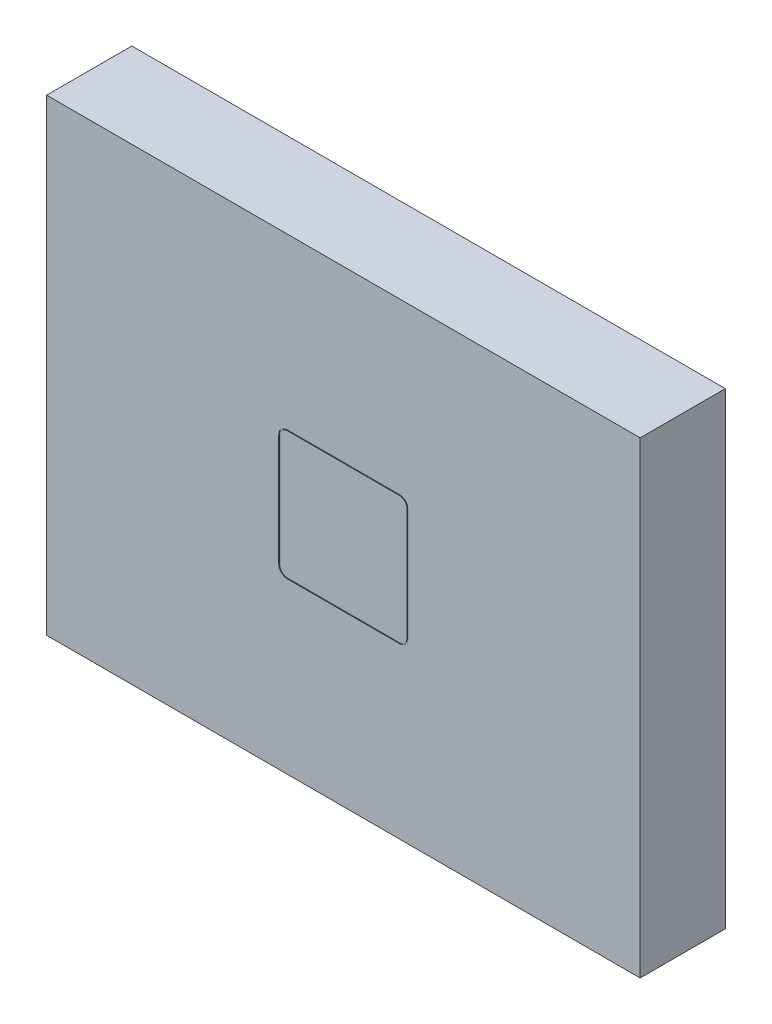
ISO-10303-21;
HEADER;
FILE_DESCRIPTION(('STEP AP214'),'2;1');
FILE_NAME('part.step','',(''),(''),'','','');
FILE_SCHEMA(('AUTOMOTIVE_DESIGN { 1 0 10303 214 1 1 1 1 }'));
ENDSEC;
DATA;
#1=APPLICATION_CONTEXT('core data for automotive mechanical design processes');
#2=APPLICATION_PROTOCOL_DEFINITION('international standard','automotive_design',2000,#1);
#3=PRODUCT_CONTEXT('',#1,'mechanical');
#4=PRODUCT('Part','Part','',(#3));
#5=PRODUCT_RELATED_PRODUCT_CATEGORY('part','',(#4));
#6=PRODUCT_DEFINITION_FORMATION('','',#4);
#7=PRODUCT_DEFINITION_CONTEXT('part definition',#1,'design');
#8=PRODUCT_DEFINITION('design','',#6,#7);
#9=PRODUCT_DEFINITION_SHAPE('','',#8);
#10=(LENGTH_UNIT() NAMED_UNIT(*) SI_UNIT(.MILLI.,.METRE.));
#11=(NAMED_UNIT(*) PLANE_ANGLE_UNIT() SI_UNIT($,.RADIAN.));
#12=(NAMED_UNIT(*) SI_UNIT($,.STERADIAN.) SOLID_ANGLE_UNIT());
#13=UNCERTAINTY_MEASURE_WITH_UNIT(LENGTH_MEASURE(1.E-05),#10,'distance_accuracy_value','');
#14=(GEOMETRIC_REPRESENTATION_CONTEXT(3) GLOBAL_UNCERTAINTY_ASSIGNED_CONTEXT((#13)) GLOBAL_UNIT_ASSIGNED_CONTEXT((#10,
#11,#12)) REPRESENTATION_CONTEXT('',''));
#15=CARTESIAN_POINT('',(0.,0.,0.));
#16=DIRECTION('',(0.,0.,1.));
#17=DIRECTION('',(1.,0.,0.));
#18=AXIS2_PLACEMENT_3D('',#15,#16,#17);
#19=CARTESIAN_POINT('',(-42500.,33500.,12195.2));
#20=DIRECTION('',(0.,-1.,0.));
#21=DIRECTION('',(1.,0.,0.));
#22=AXIS2_PLACEMENT_3D('',#19,#20,#21);
#23=PLANE('',#22);
#24=DIRECTION('',(-1.,0.,0.));
#25=VECTOR('',#24,1.);
#26=CARTESIAN_POINT('',(-42500.,33500.,0.));
#27=LINE('',#26,#25);
#28=CARTESIAN_POINT('',(42500.,33500.,0.));
#29=VERTEX_POINT('',#28);
#30=CARTESIAN_POINT('',(-42500.,33500.,0.));
#31=VERTEX_POINT('',#30);
#32=EDGE_CURVE('E350',#29,#31,#27,.T.);
#33=ORIENTED_EDGE('',*,*,#32,.T.);
#34=DIRECTION('',(0.,0.,-1.));
#35=VECTOR('',#34,1.);
#36=CARTESIAN_POINT('',(-42500.,33500.,12195.2));
#37=LINE('',#36,#35);
#38=CARTESIAN_POINT('',(-42500.,33500.,12195.2));
#39=VERTEX_POINT('',#38);
#40=EDGE_CURVE('E11',#39,#31,#37,.T.);
#41=ORIENTED_EDGE('',*,*,#40,.F.);
#42=DIRECTION('',(-1.,0.,0.));
#43=VECTOR('',#42,1.);
#44=CARTESIAN_POINT('',(-42500.,33500.,12195.2));
#45=LINE('',#44,#43);
#46=CARTESIAN_POINT('',(42500.,33500.,12195.2));
#47=VERTEX_POINT('',#46);
#48=EDGE_CURVE('E366',#47,#39,#45,.T.);
#49=ORIENTED_EDGE('',*,*,#48,.F.);
#50=DIRECTION('',(0.,0.,-1.));
#51=VECTOR('',#50,1.);
#52=CARTESIAN_POINT('',(42500.,33500.,12195.2));
#53=LINE('',#52,#51);
#54=EDGE_CURVE('E385',#47,#29,#53,.T.);
#55=ORIENTED_EDGE('',*,*,#54,.T.);
#56=EDGE_LOOP('',(#33,#41,#49,#55));
#57=FACE_BOUND('',#56,.T.);
#58=ADVANCED_FACE('F46',(#57),#23,.F.);
#59=CARTESIAN_POINT('',(-42500.,-33500.,12195.2));
#60=DIRECTION('',(1.,0.,0.));
#61=DIRECTION('',(0.,0.,-1.));
#62=AXIS2_PLACEMENT_3D('',#59,#60,#61);
#63=PLANE('',#62);
#64=DIRECTION('',(0.,-1.,0.));
#65=VECTOR('',#64,1.);
#66=CARTESIAN_POINT('',(-42500.,-33500.,0.));
#67=LINE('',#66,#65);
#68=CARTESIAN_POINT('',(-42500.,-33500.,0.));
#69=VERTEX_POINT('',#68);
#70=EDGE_CURVE('E387',#31,#69,#67,.T.);
#71=ORIENTED_EDGE('',*,*,#70,.T.);
#72=DIRECTION('',(0.,0.,-1.));
#73=VECTOR('',#72,1.);
#74=CARTESIAN_POINT('',(-42500.,-33500.,12195.2));
#75=LINE('',#74,#73);
#76=CARTESIAN_POINT('',(-42500.,-33500.,12195.2));
#77=VERTEX_POINT('',#76);
#78=EDGE_CURVE('E53',#77,#69,#75,.T.);
#79=ORIENTED_EDGE('',*,*,#78,.F.);
#80=DIRECTION('',(0.,-1.,0.));
#81=VECTOR('',#80,1.);
#82=CARTESIAN_POINT('',(-42500.,-33500.,12195.2));
#83=LINE('',#82,#81);
#84=EDGE_CURVE('E375',#39,#77,#83,.T.);
#85=ORIENTED_EDGE('',*,*,#84,.F.);
#86=ORIENTED_EDGE('',*,*,#40,.T.);
#87=EDGE_LOOP('',(#71,#79,#85,#86));
#88=FACE_BOUND('',#87,.T.);
#89=ADVANCED_FACE('F425',(#88),#63,.F.);
#90=CARTESIAN_POINT('',(-42500.,-33500.,12195.2));
#91=DIRECTION('',(0.,1.,0.));
#92=DIRECTION('',(0.,0.,1.));
#93=AXIS2_PLACEMENT_3D('',#90,#91,#92);
#94=PLANE('',#93);
#95=DIRECTION('',(1.,0.,0.));
#96=VECTOR('',#95,1.);
#97=CARTESIAN_POINT('',(-42500.,-33500.,0.));
#98=LINE('',#97,#96);
#99=CARTESIAN_POINT('',(42500.,-33500.,0.));
#100=VERTEX_POINT('',#99);
#101=EDGE_CURVE('E386',#69,#100,#98,.T.);
#102=ORIENTED_EDGE('',*,*,#101,.T.);
#103=DIRECTION('',(0.,0.,-1.));
#104=VECTOR('',#103,1.);
#105=CARTESIAN_POINT('',(42500.,-33500.,12195.2));
#106=LINE('',#105,#104);
#107=CARTESIAN_POINT('',(42500.,-33500.,12195.2));
#108=VERTEX_POINT('',#107);
#109=EDGE_CURVE('E397',#108,#100,#106,.T.);
#110=ORIENTED_EDGE('',*,*,#109,.F.);
#111=DIRECTION('',(1.,0.,0.));
#112=VECTOR('',#111,1.);
#113=CARTESIAN_POINT('',(-42500.,-33500.,12195.2));
#114=LINE('',#113,#112);
#115=EDGE_CURVE('E376',#77,#108,#114,.T.);
#116=ORIENTED_EDGE('',*,*,#115,.F.);
#117=ORIENTED_EDGE('',*,*,#78,.T.);
#118=EDGE_LOOP('',(#102,#110,#116,#117));
#119=FACE_BOUND('',#118,.T.);
#120=ADVANCED_FACE('F407',(#119),#94,.F.);
#121=CARTESIAN_POINT('',(42500.,-33500.,12195.2));
#122=DIRECTION('',(-1.,0.,0.));
#123=DIRECTION('',(0.,0.,1.));
#124=AXIS2_PLACEMENT_3D('',#121,#122,#123);
#125=PLANE('',#124);
#126=DIRECTION('',(0.,1.,0.));
#127=VECTOR('',#126,1.);
#128=CARTESIAN_POINT('',(42500.,-33500.,0.));
#129=LINE('',#128,#127);
#130=EDGE_CURVE('E373',#100,#29,#129,.T.);
#131=ORIENTED_EDGE('',*,*,#130,.T.);
#132=ORIENTED_EDGE('',*,*,#54,.F.);
#133=DIRECTION('',(0.,1.,0.));
#134=VECTOR('',#133,1.);
#135=CARTESIAN_POINT('',(42500.,-33500.,12195.2));
#136=LINE('',#135,#134);
#137=EDGE_CURVE('E377',#108,#47,#136,.T.);
#138=ORIENTED_EDGE('',*,*,#137,.F.);
#139=ORIENTED_EDGE('',*,*,#109,.T.);
#140=EDGE_LOOP('',(#131,#132,#138,#139));
#141=FACE_BOUND('',#140,.T.);
#142=ADVANCED_FACE('F415',(#141),#125,.F.);
#143=CARTESIAN_POINT('',(0.,0.,12195.2));
#144=DIRECTION('',(0.,0.,1.));
#145=DIRECTION('',(1.,0.,0.));
#146=AXIS2_PLACEMENT_3D('',#143,#144,#145);
#147=PLANE('',#146);
#148=CARTESIAN_POINT('',(-8000.72,8000.72,12195.2));
#149=DIRECTION('',(0.,0.,1.));
#150=DIRECTION('',(1.,0.,0.));
#151=AXIS2_PLACEMENT_3D('',#148,#149,#150);
#152=CIRCLE('',#151,1263.17);
#153=CARTESIAN_POINT('',(-8000.72,9263.89,12195.2));
#154=VERTEX_POINT('',#153);
#155=CARTESIAN_POINT('',(-9263.89,8000.72,12195.2));
#156=VERTEX_POINT('',#155);
#157=EDGE_CURVE('E62',#154,#156,#152,.T.);
#158=ORIENTED_EDGE('',*,*,#157,.F.);
#159=DIRECTION('',(-1.,0.,0.));
#160=VECTOR('',#159,1.);
#161=CARTESIAN_POINT('',(8000.71999999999,9263.89,12195.2));
#162=LINE('',#161,#160);
#163=CARTESIAN_POINT('',(8000.71999999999,9263.89,12195.2));
#164=VERTEX_POINT('',#163);
#165=EDGE_CURVE('E286',#164,#154,#162,.T.);
#166=ORIENTED_EDGE('',*,*,#165,.F.);
#167=CARTESIAN_POINT('',(8000.71999999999,8000.72,12195.2));
#168=DIRECTION('',(0.,0.,1.));
#169=DIRECTION('',(1.,0.,0.));
#170=AXIS2_PLACEMENT_3D('',#167,#168,#169);
#171=CIRCLE('',#170,1263.17);
#172=CARTESIAN_POINT('',(9263.88999999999,8000.72,12195.2));
#173=VERTEX_POINT('',#172);
#174=EDGE_CURVE('E340',#173,#164,#171,.T.);
#175=ORIENTED_EDGE('',*,*,#174,.F.);
#176=DIRECTION('',(0.,1.,0.));
#177=VECTOR('',#176,1.);
#178=CARTESIAN_POINT('',(9263.89,-8000.72,12195.2));
#179=LINE('',#178,#177);
#180=CARTESIAN_POINT('',(9263.89,-8000.72,12195.2));
#181=VERTEX_POINT('',#180);
#182=EDGE_CURVE('E334',#181,#173,#179,.T.);
#183=ORIENTED_EDGE('',*,*,#182,.F.);
#184=CARTESIAN_POINT('',(8000.72,-8000.72,12195.2));
#185=DIRECTION('',(0.,0.,1.));
#186=DIRECTION('',(1.,0.,0.));
#187=AXIS2_PLACEMENT_3D('',#184,#185,#186);
#188=CIRCLE('',#187,1263.17);
#189=CARTESIAN_POINT('',(8000.72,-9263.89,12195.2));
#190=VERTEX_POINT('',#189);
#191=EDGE_CURVE('E328',#190,#181,#188,.T.);
#192=ORIENTED_EDGE('',*,*,#191,.F.);
#193=DIRECTION('',(1.,0.,0.));
#194=VECTOR('',#193,1.);
#195=CARTESIAN_POINT('',(-8000.72,-9263.89,12195.2));
#196=LINE('',#195,#194);
#197=CARTESIAN_POINT('',(-8000.72,-9263.89,12195.2));
#198=VERTEX_POINT('',#197);
#199=EDGE_CURVE('E324',#198,#190,#196,.T.);
#200=ORIENTED_EDGE('',*,*,#199,.F.);
#201=CARTESIAN_POINT('',(-8000.72,-8000.72,12195.2));
#202=DIRECTION('',(0.,0.,1.));
#203=DIRECTION('',(1.,0.,0.));
#204=AXIS2_PLACEMENT_3D('',#201,#202,#203);
#205=CIRCLE('',#204,1263.17);
#206=CARTESIAN_POINT('',(-9263.89,-8000.71999999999,12195.2));
#207=VERTEX_POINT('',#206);
#208=EDGE_CURVE('E321',#207,#198,#205,.T.);
#209=ORIENTED_EDGE('',*,*,#208,.F.);
#210=DIRECTION('',(0.,-1.,0.));
#211=VECTOR('',#210,1.);
#212=CARTESIAN_POINT('',(-9263.89,8000.72,12195.2));
#213=LINE('',#212,#211);
#214=EDGE_CURVE('E320',#156,#207,#213,.T.);
#215=ORIENTED_EDGE('',*,*,#214,.F.);
#216=EDGE_LOOP('',(#158,#166,#175,#183,#192,#200,#209,#215));
#217=FACE_BOUND('',#216,.T.);
#218=ORIENTED_EDGE('',*,*,#48,.T.);
#219=ORIENTED_EDGE('',*,*,#84,.T.);
#220=ORIENTED_EDGE('',*,*,#115,.T.);
#221=ORIENTED_EDGE('',*,*,#137,.T.);
#222=EDGE_LOOP('',(#218,#219,#220,#221));
#223=FACE_BOUND('',#222,.T.);
#224=ADVANCED_FACE('F423',(#217,#223),#147,.T.);
#225=CARTESIAN_POINT('',(0.,0.,0.));
#226=DIRECTION('',(0.,0.,1.));
#227=DIRECTION('',(1.,0.,0.));
#228=AXIS2_PLACEMENT_3D('',#225,#226,#227);
#229=PLANE('',#228);
#230=ORIENTED_EDGE('',*,*,#32,.F.);
#231=ORIENTED_EDGE('',*,*,#130,.F.);
#232=ORIENTED_EDGE('',*,*,#101,.F.);
#233=ORIENTED_EDGE('',*,*,#70,.F.);
#234=EDGE_LOOP('',(#230,#231,#232,#233));
#235=FACE_BOUND('',#234,.T.);
#236=ADVANCED_FACE('F412',(#235),#229,.F.);
#237=CARTESIAN_POINT('',(-8000.72,8000.72,12112.65));
#238=DIRECTION('',(0.,0.,1.));
#239=DIRECTION('',(1.,0.,0.));
#240=AXIS2_PLACEMENT_3D('',#237,#238,#239);
#241=CYLINDRICAL_SURFACE('',#240,1263.17);
#242=ORIENTED_EDGE('',*,*,#157,.T.);
#243=DIRECTION('',(0.,0.,1.));
#244=VECTOR('',#243,1.);
#245=CARTESIAN_POINT('',(-9263.89,8000.72,12112.65));
#246=LINE('',#245,#244);
#247=CARTESIAN_POINT('',(-9263.89,8000.72,12112.65));
#248=VERTEX_POINT('',#247);
#249=EDGE_CURVE('E314',#248,#156,#246,.T.);
#250=ORIENTED_EDGE('',*,*,#249,.F.);
#251=CARTESIAN_POINT('',(-8000.72,8000.72,12112.65));
#252=DIRECTION('',(0.,0.,1.));
#253=DIRECTION('',(1.,0.,0.));
#254=AXIS2_PLACEMENT_3D('',#251,#252,#253);
#255=CIRCLE('',#254,1263.17);
#256=CARTESIAN_POINT('',(-8000.72,9263.89,12112.65));
#257=VERTEX_POINT('',#256);
#258=EDGE_CURVE('E282',#257,#248,#255,.T.);
#259=ORIENTED_EDGE('',*,*,#258,.F.);
#260=DIRECTION('',(0.,0.,1.));
#261=VECTOR('',#260,1.);
#262=CARTESIAN_POINT('',(-8000.72,9263.89,12112.65));
#263=LINE('',#262,#261);
#264=EDGE_CURVE('E343',#257,#154,#263,.T.);
#265=ORIENTED_EDGE('',*,*,#264,.T.);
#266=EDGE_LOOP('',(#242,#250,#259,#265));
#267=FACE_BOUND('',#266,.T.);
#268=ADVANCED_FACE('F432',(#267),#241,.F.);
#269=CARTESIAN_POINT('',(8000.71999999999,9263.89,12112.65));
#270=DIRECTION('',(0.,1.,0.));
#271=DIRECTION('',(0.,0.,1.));
#272=AXIS2_PLACEMENT_3D('',#269,#270,#271);
#273=PLANE('',#272);
#274=ORIENTED_EDGE('',*,*,#165,.T.);
#275=ORIENTED_EDGE('',*,*,#264,.F.);
#276=DIRECTION('',(-1.,0.,0.));
#277=VECTOR('',#276,1.);
#278=CARTESIAN_POINT('',(8000.71999999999,9263.89,12112.65));
#279=LINE('',#278,#277);
#280=CARTESIAN_POINT('',(8000.71999999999,9263.89,12112.65));
#281=VERTEX_POINT('',#280);
#282=EDGE_CURVE('E309',#281,#257,#279,.T.);
#283=ORIENTED_EDGE('',*,*,#282,.F.);
#284=DIRECTION('',(0.,0.,1.));
#285=VECTOR('',#284,1.);
#286=CARTESIAN_POINT('',(8000.71999999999,9263.89,12112.65));
#287=LINE('',#286,#285);
#288=EDGE_CURVE('E346',#281,#164,#287,.T.);
#289=ORIENTED_EDGE('',*,*,#288,.T.);
#290=EDGE_LOOP('',(#274,#275,#283,#289));
#291=FACE_BOUND('',#290,.T.);
#292=ADVANCED_FACE('F442',(#291),#273,.F.);
#293=CARTESIAN_POINT('',(8000.71999999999,8000.72,12112.65));
#294=DIRECTION('',(0.,0.,1.));
#295=DIRECTION('',(1.,0.,0.));
#296=AXIS2_PLACEMENT_3D('',#293,#294,#295);
#297=CYLINDRICAL_SURFACE('',#296,1263.17);
#298=ORIENTED_EDGE('',*,*,#174,.T.);
#299=ORIENTED_EDGE('',*,*,#288,.F.);
#300=CARTESIAN_POINT('',(8000.71999999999,8000.72,12112.65));
#301=DIRECTION('',(0.,0.,1.));
#302=DIRECTION('',(1.,0.,0.));
#303=AXIS2_PLACEMENT_3D('',#300,#301,#302);
#304=CIRCLE('',#303,1263.17);
#305=CARTESIAN_POINT('',(9263.88999999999,8000.72,12112.65));
#306=VERTEX_POINT('',#305);
#307=EDGE_CURVE('E308',#306,#281,#304,.T.);
#308=ORIENTED_EDGE('',*,*,#307,.F.);
#309=DIRECTION('',(0.,0.,1.));
#310=VECTOR('',#309,1.);
#311=CARTESIAN_POINT('',(9263.88999999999,8000.72,12112.65));
#312=LINE('',#311,#310);
#313=EDGE_CURVE('E352',#306,#173,#312,.T.);
#314=ORIENTED_EDGE('',*,*,#313,.T.);
#315=EDGE_LOOP('',(#298,#299,#308,#314));
#316=FACE_BOUND('',#315,.T.);
#317=ADVANCED_FACE('F462',(#316),#297,.F.);
#318=CARTESIAN_POINT('',(9263.89,-8000.72,12112.65));
#319=DIRECTION('',(1.,0.,0.));
#320=DIRECTION('',(0.,1.,0.));
#321=AXIS2_PLACEMENT_3D('',#318,#319,#320);
#322=PLANE('',#321);
#323=ORIENTED_EDGE('',*,*,#182,.T.);
#324=ORIENTED_EDGE('',*,*,#313,.F.);
#325=DIRECTION('',(0.,1.,0.));
#326=VECTOR('',#325,1.);
#327=CARTESIAN_POINT('',(9263.89,-8000.72,12112.65));
#328=LINE('',#327,#326);
#329=CARTESIAN_POINT('',(9263.89,-8000.72,12112.65));
#330=VERTEX_POINT('',#329);
#331=EDGE_CURVE('E302',#330,#306,#328,.T.);
#332=ORIENTED_EDGE('',*,*,#331,.F.);
#333=DIRECTION('',(0.,0.,1.));
#334=VECTOR('',#333,1.);
#335=CARTESIAN_POINT('',(9263.89,-8000.72,12112.65));
#336=LINE('',#335,#334);
#337=EDGE_CURVE('E351',#330,#181,#336,.T.);
#338=ORIENTED_EDGE('',*,*,#337,.T.);
#339=EDGE_LOOP('',(#323,#324,#332,#338));
#340=FACE_BOUND('',#339,.T.);
#341=ADVANCED_FACE('F460',(#340),#322,.F.);
#342=CARTESIAN_POINT('',(8000.72,-8000.72,12112.65));
#343=DIRECTION('',(0.,0.,1.));
#344=DIRECTION('',(1.,0.,0.));
#345=AXIS2_PLACEMENT_3D('',#342,#343,#344);
#346=CYLINDRICAL_SURFACE('',#345,1263.17);
#347=ORIENTED_EDGE('',*,*,#191,.T.);
#348=ORIENTED_EDGE('',*,*,#337,.F.);
#349=CARTESIAN_POINT('',(8000.72,-8000.72,12112.65));
#350=DIRECTION('',(0.,0.,1.));
#351=DIRECTION('',(1.,0.,0.));
#352=AXIS2_PLACEMENT_3D('',#349,#350,#351);
#353=CIRCLE('',#352,1263.17);
#354=CARTESIAN_POINT('',(8000.72,-9263.89,12112.65));
#355=VERTEX_POINT('',#354);
#356=EDGE_CURVE('E299',#355,#330,#353,.T.);
#357=ORIENTED_EDGE('',*,*,#356,.F.);
#358=DIRECTION('',(0.,0.,1.));
#359=VECTOR('',#358,1.);
#360=CARTESIAN_POINT('',(8000.72,-9263.89,12112.65));
#361=LINE('',#360,#359);
#362=EDGE_CURVE('E357',#355,#190,#361,.T.);
#363=ORIENTED_EDGE('',*,*,#362,.T.);
#364=EDGE_LOOP('',(#347,#348,#357,#363));
#365=FACE_BOUND('',#364,.T.);
#366=ADVANCED_FACE('F454',(#365),#346,.F.);
#367=CARTESIAN_POINT('',(-8000.72,-9263.89,12112.65));
#368=DIRECTION('',(0.,-1.,0.));
#369=DIRECTION('',(1.,0.,0.));
#370=AXIS2_PLACEMENT_3D('',#367,#368,#369);
#371=PLANE('',#370);
#372=ORIENTED_EDGE('',*,*,#199,.T.);
#373=ORIENTED_EDGE('',*,*,#362,.F.);
#374=DIRECTION('',(1.,0.,0.));
#375=VECTOR('',#374,1.);
#376=CARTESIAN_POINT('',(-8000.72,-9263.89,12112.65));
#377=LINE('',#376,#375);
#378=CARTESIAN_POINT('',(-8000.72,-9263.89,12112.65));
#379=VERTEX_POINT('',#378);
#380=EDGE_CURVE('E294',#379,#355,#377,.T.);
#381=ORIENTED_EDGE('',*,*,#380,.F.);
#382=DIRECTION('',(0.,0.,1.));
#383=VECTOR('',#382,1.);
#384=CARTESIAN_POINT('',(-8000.72,-9263.89,12112.65));
#385=LINE('',#384,#383);
#386=EDGE_CURVE('E360',#379,#198,#385,.T.);
#387=ORIENTED_EDGE('',*,*,#386,.T.);
#388=EDGE_LOOP('',(#372,#373,#381,#387));
#389=FACE_BOUND('',#388,.T.);
#390=ADVANCED_FACE('F446',(#389),#371,.F.);
#391=CARTESIAN_POINT('',(-8000.72,-8000.72,12112.65));
#392=DIRECTION('',(0.,0.,1.));
#393=DIRECTION('',(1.,0.,0.));
#394=AXIS2_PLACEMENT_3D('',#391,#392,#393);
#395=CYLINDRICAL_SURFACE('',#394,1263.17);
#396=ORIENTED_EDGE('',*,*,#208,.T.);
#397=ORIENTED_EDGE('',*,*,#386,.F.);
#398=CARTESIAN_POINT('',(-8000.72,-8000.72,12112.65));
#399=DIRECTION('',(0.,0.,1.));
#400=DIRECTION('',(1.,0.,0.));
#401=AXIS2_PLACEMENT_3D('',#398,#399,#400);
#402=CIRCLE('',#401,1263.17);
#403=CARTESIAN_POINT('',(-9263.89,-8000.71999999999,12112.65));
#404=VERTEX_POINT('',#403);
#405=EDGE_CURVE('E290',#404,#379,#402,.T.);
#406=ORIENTED_EDGE('',*,*,#405,.F.);
#407=DIRECTION('',(0.,0.,1.));
#408=VECTOR('',#407,1.);
#409=CARTESIAN_POINT('',(-9263.89,-8000.71999999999,12112.65));
#410=LINE('',#409,#408);
#411=EDGE_CURVE('E361',#404,#207,#410,.T.);
#412=ORIENTED_EDGE('',*,*,#411,.T.);
#413=EDGE_LOOP('',(#396,#397,#406,#412));
#414=FACE_BOUND('',#413,.T.);
#415=ADVANCED_FACE('F443',(#414),#395,.F.);
#416=CARTESIAN_POINT('',(-9263.89,8000.72,12112.65));
#417=DIRECTION('',(-1.,0.,0.));
#418=DIRECTION('',(0.,0.,1.));
#419=AXIS2_PLACEMENT_3D('',#416,#417,#418);
#420=PLANE('',#419);
#421=ORIENTED_EDGE('',*,*,#214,.T.);
#422=ORIENTED_EDGE('',*,*,#411,.F.);
#423=DIRECTION('',(0.,-1.,0.));
#424=VECTOR('',#423,1.);
#425=CARTESIAN_POINT('',(-9263.89,8000.72,12112.65));
#426=LINE('',#425,#424);
#427=EDGE_CURVE('E283',#248,#404,#426,.T.);
#428=ORIENTED_EDGE('',*,*,#427,.F.);
#429=ORIENTED_EDGE('',*,*,#249,.T.);
#430=EDGE_LOOP('',(#421,#422,#428,#429));
#431=FACE_BOUND('',#430,.T.);
#432=ADVANCED_FACE('F445',(#431),#420,.F.);
#433=CARTESIAN_POINT('',(-8000.72,8000.72,12112.65));
#434=DIRECTION('',(0.,0.,1.));
#435=DIRECTION('',(1.,0.,0.));
#436=AXIS2_PLACEMENT_3D('',#433,#434,#435);
#437=PLANE('',#436);
#438=DIRECTION('',(0.,-1.,0.));
#439=VECTOR('',#438,1.);
#440=CARTESIAN_POINT('',(-9111.49000000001,8000.72,12112.65));
#441=LINE('',#440,#439);
#442=CARTESIAN_POINT('',(-9111.49000000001,8000.72,12112.65));
#443=VERTEX_POINT('',#442);
#444=CARTESIAN_POINT('',(-9111.49000000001,-8000.71999999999,12112.65));
#445=VERTEX_POINT('',#444);
#446=EDGE_CURVE('E198',#443,#445,#441,.T.);
#447=ORIENTED_EDGE('',*,*,#446,.F.);
#448=CARTESIAN_POINT('',(-8000.72,8000.72,12112.65));
#449=DIRECTION('',(0.,0.,1.));
#450=DIRECTION('',(1.,0.,0.));
#451=AXIS2_PLACEMENT_3D('',#448,#449,#450);
#452=CIRCLE('',#451,1110.77);
#453=CARTESIAN_POINT('',(-8000.72,9111.49000000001,12112.65));
#454=VERTEX_POINT('',#453);
#455=EDGE_CURVE('E233',#454,#443,#452,.T.);
#456=ORIENTED_EDGE('',*,*,#455,.F.);
#457=DIRECTION('',(-1.,0.,0.));
#458=VECTOR('',#457,1.);
#459=CARTESIAN_POINT('',(8000.71999999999,9111.49,12112.65));
#460=LINE('',#459,#458);
#461=CARTESIAN_POINT('',(8000.71999999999,9111.49,12112.65));
#462=VERTEX_POINT('',#461);
#463=EDGE_CURVE('E228',#462,#454,#460,.T.);
#464=ORIENTED_EDGE('',*,*,#463,.F.);
#465=CARTESIAN_POINT('',(8000.71999999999,8000.72,12112.65));
#466=DIRECTION('',(0.,0.,1.));
#467=DIRECTION('',(1.,0.,0.));
#468=AXIS2_PLACEMENT_3D('',#465,#466,#467);
#469=CIRCLE('',#468,1110.77);
#470=CARTESIAN_POINT('',(9111.48999999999,8000.72,12112.65));
#471=VERTEX_POINT('',#470);
#472=EDGE_CURVE('E227',#471,#462,#469,.T.);
#473=ORIENTED_EDGE('',*,*,#472,.F.);
#474=DIRECTION('',(0.,1.,0.));
#475=VECTOR('',#474,1.);
#476=CARTESIAN_POINT('',(9111.49,-8000.72,12112.65));
#477=LINE('',#476,#475);
#478=CARTESIAN_POINT('',(9111.49,-8000.72,12112.65));
#479=VERTEX_POINT('',#478);
#480=EDGE_CURVE('E225',#479,#471,#477,.T.);
#481=ORIENTED_EDGE('',*,*,#480,.F.);
#482=CARTESIAN_POINT('',(8000.72,-8000.72,12112.65));
#483=DIRECTION('',(0.,0.,1.));
#484=DIRECTION('',(1.,0.,0.));
#485=AXIS2_PLACEMENT_3D('',#482,#483,#484);
#486=CIRCLE('',#485,1110.77);
#487=CARTESIAN_POINT('',(8000.72,-9111.49,12112.65));
#488=VERTEX_POINT('',#487);
#489=EDGE_CURVE('E210',#488,#479,#486,.T.);
#490=ORIENTED_EDGE('',*,*,#489,.F.);
#491=DIRECTION('',(1.,0.,0.));
#492=VECTOR('',#491,1.);
#493=CARTESIAN_POINT('',(-8000.72,-9111.49,12112.65));
#494=LINE('',#493,#492);
#495=CARTESIAN_POINT('',(-8000.72,-9111.49,12112.65));
#496=VERTEX_POINT('',#495);
#497=EDGE_CURVE('E190',#496,#488,#494,.T.);
#498=ORIENTED_EDGE('',*,*,#497,.F.);
#499=CARTESIAN_POINT('',(-8000.72,-8000.72,12112.65));
#500=DIRECTION('',(0.,0.,1.));
#501=DIRECTION('',(1.,0.,0.));
#502=AXIS2_PLACEMENT_3D('',#499,#500,#501);
#503=CIRCLE('',#502,1110.77);
#504=EDGE_CURVE('E201',#445,#496,#503,.T.);
#505=ORIENTED_EDGE('',*,*,#504,.F.);
#506=EDGE_LOOP('',(#447,#456,#464,#473,#481,#490,#498,#505));
#507=FACE_BOUND('',#506,.T.);
#508=ORIENTED_EDGE('',*,*,#258,.T.);
#509=ORIENTED_EDGE('',*,*,#427,.T.);
#510=ORIENTED_EDGE('',*,*,#405,.T.);
#511=ORIENTED_EDGE('',*,*,#380,.T.);
#512=ORIENTED_EDGE('',*,*,#356,.T.);
#513=ORIENTED_EDGE('',*,*,#331,.T.);
#514=ORIENTED_EDGE('',*,*,#307,.T.);
#515=ORIENTED_EDGE('',*,*,#282,.T.);
#516=EDGE_LOOP('',(#508,#509,#510,#511,#512,#513,#514,#515));
#517=FACE_BOUND('',#516,.T.);
#518=ADVANCED_FACE('F203',(#507,#517),#437,.T.);
#519=CARTESIAN_POINT('',(-8000.72,-8000.72,12112.65));
#520=DIRECTION('',(0.,0.,1.));
#521=DIRECTION('',(1.,0.,0.));
#522=AXIS2_PLACEMENT_3D('',#519,#520,#521);
#523=CYLINDRICAL_SURFACE('',#522,1110.77);
#524=CARTESIAN_POINT('',(-8000.72,-8000.72,12195.2));
#525=DIRECTION('',(0.,0.,1.));
#526=DIRECTION('',(1.,0.,0.));
#527=AXIS2_PLACEMENT_3D('',#524,#525,#526);
#528=CIRCLE('',#527,1110.77);
#529=CARTESIAN_POINT('',(-9111.49000000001,-8000.71999999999,12195.2));
#530=VERTEX_POINT('',#529);
#531=CARTESIAN_POINT('',(-8000.72,-9111.49,12195.2));
#532=VERTEX_POINT('',#531);
#533=EDGE_CURVE('E238',#530,#532,#528,.T.);
#534=ORIENTED_EDGE('',*,*,#533,.F.);
#535=DIRECTION('',(0.,0.,1.));
#536=VECTOR('',#535,1.);
#537=CARTESIAN_POINT('',(-9111.49000000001,-8000.71999999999,12112.65));
#538=LINE('',#537,#536);
#539=EDGE_CURVE('E211',#445,#530,#538,.T.);
#540=ORIENTED_EDGE('',*,*,#539,.F.);
#541=ORIENTED_EDGE('',*,*,#504,.T.);
#542=DIRECTION('',(0.,0.,1.));
#543=VECTOR('',#542,1.);
#544=CARTESIAN_POINT('',(-8000.72,-9111.49,12112.65));
#545=LINE('',#544,#543);
#546=EDGE_CURVE('E184',#496,#532,#545,.T.);
#547=ORIENTED_EDGE('',*,*,#546,.T.);
#548=EDGE_LOOP('',(#534,#540,#541,#547));
#549=FACE_BOUND('',#548,.T.);
#550=ADVANCED_FACE('F209',(#549),#523,.T.);
#551=CARTESIAN_POINT('',(-9111.49000000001,8000.72,12112.65));
#552=DIRECTION('',(-1.,0.,0.));
#553=DIRECTION('',(0.,-1.,0.));
#554=AXIS2_PLACEMENT_3D('',#551,#552,#553);
#555=PLANE('',#554);
#556=DIRECTION('',(0.,-1.,0.));
#557=VECTOR('',#556,1.);
#558=CARTESIAN_POINT('',(-9111.49000000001,8000.72,12195.2));
#559=LINE('',#558,#557);
#560=CARTESIAN_POINT('',(-9111.49000000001,8000.72,12195.2));
#561=VERTEX_POINT('',#560);
#562=EDGE_CURVE('E213',#561,#530,#559,.T.);
#563=ORIENTED_EDGE('',*,*,#562,.F.);
#564=DIRECTION('',(0.,0.,1.));
#565=VECTOR('',#564,1.);
#566=CARTESIAN_POINT('',(-9111.49000000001,8000.72,12112.65));
#567=LINE('',#566,#565);
#568=EDGE_CURVE('E262',#443,#561,#567,.T.);
#569=ORIENTED_EDGE('',*,*,#568,.F.);
#570=ORIENTED_EDGE('',*,*,#446,.T.);
#571=ORIENTED_EDGE('',*,*,#539,.T.);
#572=EDGE_LOOP('',(#563,#569,#570,#571));
#573=FACE_BOUND('',#572,.T.);
#574=ADVANCED_FACE('F471',(#573),#555,.T.);
#575=CARTESIAN_POINT('',(-8000.72,8000.72,12112.65));
#576=DIRECTION('',(0.,0.,1.));
#577=DIRECTION('',(1.,0.,0.));
#578=AXIS2_PLACEMENT_3D('',#575,#576,#577);
#579=CYLINDRICAL_SURFACE('',#578,1110.77);
#580=CARTESIAN_POINT('',(-8000.72,8000.72,12195.2));
#581=DIRECTION('',(0.,0.,1.));
#582=DIRECTION('',(1.,0.,0.));
#583=AXIS2_PLACEMENT_3D('',#580,#581,#582);
#584=CIRCLE('',#583,1110.77);
#585=CARTESIAN_POINT('',(-8000.72,9111.49000000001,12195.2));
#586=VERTEX_POINT('',#585);
#587=EDGE_CURVE('E220',#586,#561,#584,.T.);
#588=ORIENTED_EDGE('',*,*,#587,.F.);
#589=DIRECTION('',(0.,0.,1.));
#590=VECTOR('',#589,1.);
#591=CARTESIAN_POINT('',(-8000.72,9111.49000000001,12112.65));
#592=LINE('',#591,#590);
#593=EDGE_CURVE('E270',#454,#586,#592,.T.);
#594=ORIENTED_EDGE('',*,*,#593,.F.);
#595=ORIENTED_EDGE('',*,*,#455,.T.);
#596=ORIENTED_EDGE('',*,*,#568,.T.);
#597=EDGE_LOOP('',(#588,#594,#595,#596));
#598=FACE_BOUND('',#597,.T.);
#599=ADVANCED_FACE('F489',(#598),#579,.T.);
#600=CARTESIAN_POINT('',(8000.71999999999,9111.49,12112.65));
#601=DIRECTION('',(0.,1.,0.));
#602=DIRECTION('',(-1.,0.,0.));
#603=AXIS2_PLACEMENT_3D('',#600,#601,#602);
#604=PLANE('',#603);
#605=DIRECTION('',(-1.,0.,0.));
#606=VECTOR('',#605,1.);
#607=CARTESIAN_POINT('',(8000.71999999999,9111.49,12195.2));
#608=LINE('',#607,#606);
#609=CARTESIAN_POINT('',(8000.71999999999,9111.49,12195.2));
#610=VERTEX_POINT('',#609);
#611=EDGE_CURVE('E254',#610,#586,#608,.T.);
#612=ORIENTED_EDGE('',*,*,#611,.F.);
#613=DIRECTION('',(0.,0.,1.));
#614=VECTOR('',#613,1.);
#615=CARTESIAN_POINT('',(8000.71999999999,9111.49,12112.65));
#616=LINE('',#615,#614);
#617=EDGE_CURVE('E269',#462,#610,#616,.T.);
#618=ORIENTED_EDGE('',*,*,#617,.F.);
#619=ORIENTED_EDGE('',*,*,#463,.T.);
#620=ORIENTED_EDGE('',*,*,#593,.T.);
#621=EDGE_LOOP('',(#612,#618,#619,#620));
#622=FACE_BOUND('',#621,.T.);
#623=ADVANCED_FACE('F486',(#622),#604,.T.);
#624=CARTESIAN_POINT('',(8000.71999999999,8000.72,12112.65));
#625=DIRECTION('',(0.,0.,1.));
#626=DIRECTION('',(1.,0.,0.));
#627=AXIS2_PLACEMENT_3D('',#624,#625,#626);
#628=CYLINDRICAL_SURFACE('',#627,1110.77);
#629=CARTESIAN_POINT('',(8000.71999999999,8000.72,12195.2));
#630=DIRECTION('',(0.,0.,1.));
#631=DIRECTION('',(1.,0.,0.));
#632=AXIS2_PLACEMENT_3D('',#629,#630,#631);
#633=CIRCLE('',#632,1110.77);
#634=CARTESIAN_POINT('',(9111.48999999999,8000.72,12195.2));
#635=VERTEX_POINT('',#634);
#636=EDGE_CURVE('E253',#635,#610,#633,.T.);
#637=ORIENTED_EDGE('',*,*,#636,.F.);
#638=DIRECTION('',(0.,0.,1.));
#639=VECTOR('',#638,1.);
#640=CARTESIAN_POINT('',(9111.48999999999,8000.72,12112.65));
#641=LINE('',#640,#639);
#642=EDGE_CURVE('E272',#471,#635,#641,.T.);
#643=ORIENTED_EDGE('',*,*,#642,.F.);
#644=ORIENTED_EDGE('',*,*,#472,.T.);
#645=ORIENTED_EDGE('',*,*,#617,.T.);
#646=EDGE_LOOP('',(#637,#643,#644,#645));
#647=FACE_BOUND('',#646,.T.);
#648=ADVANCED_FACE('F485',(#647),#628,.T.);
#649=CARTESIAN_POINT('',(9111.49,-8000.72,12112.65));
#650=DIRECTION('',(1.,0.,0.));
#651=DIRECTION('',(0.,1.,0.));
#652=AXIS2_PLACEMENT_3D('',#649,#650,#651);
#653=PLANE('',#652);
#654=DIRECTION('',(0.,1.,0.));
#655=VECTOR('',#654,1.);
#656=CARTESIAN_POINT('',(9111.49,-8000.72,12195.2));
#657=LINE('',#656,#655);
#658=CARTESIAN_POINT('',(9111.49,-8000.72,12195.2));
#659=VERTEX_POINT('',#658);
#660=EDGE_CURVE('E247',#659,#635,#657,.T.);
#661=ORIENTED_EDGE('',*,*,#660,.F.);
#662=DIRECTION('',(0.,0.,1.));
#663=VECTOR('',#662,1.);
#664=CARTESIAN_POINT('',(9111.49,-8000.72,12112.65));
#665=LINE('',#664,#663);
#666=EDGE_CURVE('E277',#479,#659,#665,.T.);
#667=ORIENTED_EDGE('',*,*,#666,.F.);
#668=ORIENTED_EDGE('',*,*,#480,.T.);
#669=ORIENTED_EDGE('',*,*,#642,.T.);
#670=EDGE_LOOP('',(#661,#667,#668,#669));
#671=FACE_BOUND('',#670,.T.);
#672=ADVANCED_FACE('F479',(#671),#653,.T.);
#673=CARTESIAN_POINT('',(8000.72,-8000.72,12112.65));
#674=DIRECTION('',(0.,0.,1.));
#675=DIRECTION('',(1.,0.,0.));
#676=AXIS2_PLACEMENT_3D('',#673,#674,#675);
#677=CYLINDRICAL_SURFACE('',#676,1110.77);
#678=CARTESIAN_POINT('',(8000.72,-8000.72,12195.2));
#679=DIRECTION('',(0.,0.,1.));
#680=DIRECTION('',(1.,0.,0.));
#681=AXIS2_PLACEMENT_3D('',#678,#679,#680);
#682=CIRCLE('',#681,1110.77);
#683=CARTESIAN_POINT('',(8000.72,-9111.49,12195.2));
#684=VERTEX_POINT('',#683);
#685=EDGE_CURVE('E68',#684,#659,#682,.T.);
#686=ORIENTED_EDGE('',*,*,#685,.F.);
#687=DIRECTION('',(0.,0.,1.));
#688=VECTOR('',#687,1.);
#689=CARTESIAN_POINT('',(8000.72,-9111.49,12112.65));
#690=LINE('',#689,#688);
#691=EDGE_CURVE('E195',#488,#684,#690,.T.);
#692=ORIENTED_EDGE('',*,*,#691,.F.);
#693=ORIENTED_EDGE('',*,*,#489,.T.);
#694=ORIENTED_EDGE('',*,*,#666,.T.);
#695=EDGE_LOOP('',(#686,#692,#693,#694));
#696=FACE_BOUND('',#695,.T.);
#697=ADVANCED_FACE('F478',(#696),#677,.T.);
#698=CARTESIAN_POINT('',(-8000.72,-9111.49,12112.65));
#699=DIRECTION('',(0.,-1.,0.));
#700=DIRECTION('',(1.,0.,0.));
#701=AXIS2_PLACEMENT_3D('',#698,#699,#700);
#702=PLANE('',#701);
#703=DIRECTION('',(1.,0.,0.));
#704=VECTOR('',#703,1.);
#705=CARTESIAN_POINT('',(-8000.72,-9111.49,12195.2));
#706=LINE('',#705,#704);
#707=EDGE_CURVE('E186',#532,#684,#706,.T.);
#708=ORIENTED_EDGE('',*,*,#707,.F.);
#709=ORIENTED_EDGE('',*,*,#546,.F.);
#710=ORIENTED_EDGE('',*,*,#497,.T.);
#711=ORIENTED_EDGE('',*,*,#691,.T.);
#712=EDGE_LOOP('',(#708,#709,#710,#711));
#713=FACE_BOUND('',#712,.T.);
#714=ADVANCED_FACE('F187',(#713),#702,.T.);
#715=ORIENTED_EDGE('',*,*,#562,.T.);
#716=ORIENTED_EDGE('',*,*,#533,.T.);
#717=ORIENTED_EDGE('',*,*,#707,.T.);
#718=ORIENTED_EDGE('',*,*,#685,.T.);
#719=ORIENTED_EDGE('',*,*,#660,.T.);
#720=ORIENTED_EDGE('',*,*,#636,.T.);
#721=ORIENTED_EDGE('',*,*,#611,.T.);
#722=ORIENTED_EDGE('',*,*,#587,.T.);
#723=EDGE_LOOP('',(#715,#716,#717,#718,#719,#720,#721,#722));
#724=FACE_BOUND('',#723,.T.);
#725=ADVANCED_FACE('F437',(#724),#147,.T.);
#726=CLOSED_SHELL('',(#58,#89,#120,#142,#224,#236,#268,#292,#317,#341,#366,#390,#415,#432,#518,
#550,#574,#599,#623,#648,#672,#697,#714,#725));
#727=MANIFOLD_SOLID_BREP('B2',#726);
#728=ADVANCED_BREP_SHAPE_REPRESENTATION('',(#18,#727),#14);
#729=SHAPE_DEFINITION_REPRESENTATION(#9,#728);
ENDSEC;
END-ISO-10303-21;
